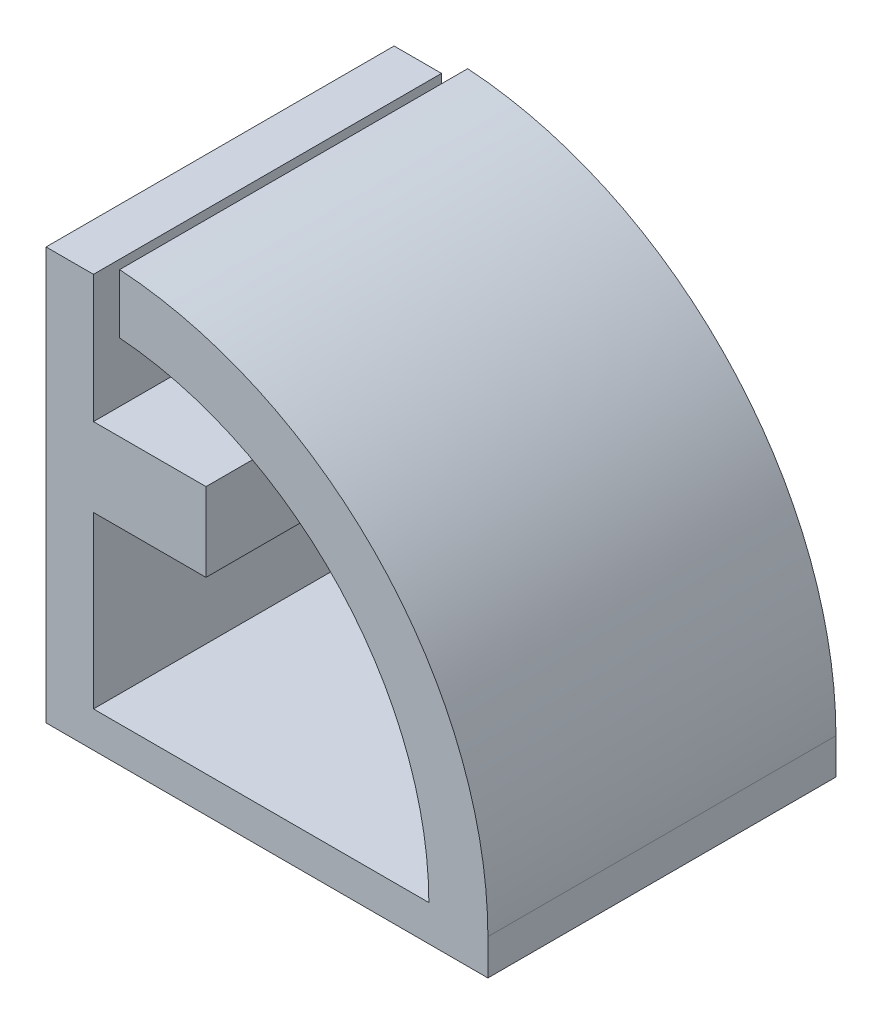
ISO-10303-21;
HEADER;
FILE_DESCRIPTION(('STEP AP214'),'2;1');
FILE_NAME('part.step','',(''),(''),'','','');
FILE_SCHEMA(('AUTOMOTIVE_DESIGN { 1 0 10303 214 1 1 1 1 }'));
ENDSEC;
DATA;
#1=APPLICATION_CONTEXT('core data for automotive mechanical design processes');
#2=APPLICATION_PROTOCOL_DEFINITION('international standard','automotive_design',2000,#1);
#3=PRODUCT_CONTEXT('',#1,'mechanical');
#4=PRODUCT('Part','Part','',(#3));
#5=PRODUCT_RELATED_PRODUCT_CATEGORY('part','',(#4));
#6=PRODUCT_DEFINITION_FORMATION('','',#4);
#7=PRODUCT_DEFINITION_CONTEXT('part definition',#1,'design');
#8=PRODUCT_DEFINITION('design','',#6,#7);
#9=PRODUCT_DEFINITION_SHAPE('','',#8);
#10=(LENGTH_UNIT() NAMED_UNIT(*) SI_UNIT(.MILLI.,.METRE.));
#11=(NAMED_UNIT(*) PLANE_ANGLE_UNIT() SI_UNIT($,.RADIAN.));
#12=(NAMED_UNIT(*) SI_UNIT($,.STERADIAN.) SOLID_ANGLE_UNIT());
#13=UNCERTAINTY_MEASURE_WITH_UNIT(LENGTH_MEASURE(1.E-05),#10,'distance_accuracy_value','');
#14=(GEOMETRIC_REPRESENTATION_CONTEXT(3) GLOBAL_UNCERTAINTY_ASSIGNED_CONTEXT((#13)) GLOBAL_UNIT_ASSIGNED_CONTEXT((#10,
#11,#12)) REPRESENTATION_CONTEXT('',''));
#15=CARTESIAN_POINT('',(0.,0.,0.));
#16=DIRECTION('',(0.,0.,1.));
#17=DIRECTION('',(1.,0.,0.));
#18=AXIS2_PLACEMENT_3D('',#15,#16,#17);
#19=CARTESIAN_POINT('',(168.839701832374,13.684496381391,66.5));
#20=DIRECTION('',(0.,-1.,0.));
#21=DIRECTION('',(0.,0.,-1.));
#22=AXIS2_PLACEMENT_3D('',#19,#20,#21);
#23=PLANE('',#22);
#24=DIRECTION('',(0.,0.,1.));
#25=VECTOR('',#24,1.);
#26=CARTESIAN_POINT('',(146.279375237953,13.684496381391,66.5));
#27=LINE('',#26,#25);
#28=CARTESIAN_POINT('',(146.279375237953,13.684496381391,-66.5));
#29=VERTEX_POINT('',#28);
#30=CARTESIAN_POINT('',(146.279375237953,13.684496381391,66.5));
#31=VERTEX_POINT('',#30);
#32=EDGE_CURVE('E140',#29,#31,#27,.T.);
#33=ORIENTED_EDGE('',*,*,#32,.F.);
#34=DIRECTION('',(-1.,0.,0.));
#35=VECTOR('',#34,1.);
#36=CARTESIAN_POINT('',(168.839701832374,13.684496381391,-66.5));
#37=LINE('',#36,#35);
#38=CARTESIAN_POINT('',(18.1175022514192,13.684496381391,-66.5));
#39=VERTEX_POINT('',#38);
#40=EDGE_CURVE('E216',#29,#39,#37,.T.);
#41=ORIENTED_EDGE('',*,*,#40,.T.);
#42=DIRECTION('',(0.,0.,-1.));
#43=VECTOR('',#42,1.);
#44=CARTESIAN_POINT('',(18.1175022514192,13.684496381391,66.5));
#45=LINE('',#44,#43);
#46=CARTESIAN_POINT('',(18.1175022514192,13.684496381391,66.5));
#47=VERTEX_POINT('',#46);
#48=EDGE_CURVE('E222',#47,#39,#45,.T.);
#49=ORIENTED_EDGE('',*,*,#48,.F.);
#50=DIRECTION('',(-1.,0.,0.));
#51=VECTOR('',#50,1.);
#52=CARTESIAN_POINT('',(168.839701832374,13.684496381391,66.5));
#53=LINE('',#52,#51);
#54=EDGE_CURVE('E48',#31,#47,#53,.T.);
#55=ORIENTED_EDGE('',*,*,#54,.F.);
#56=EDGE_LOOP('',(#33,#41,#49,#55));
#57=FACE_BOUND('',#56,.T.);
#58=ADVANCED_FACE('F33',(#57),#23,.F.);
#59=CARTESIAN_POINT('',(18.1175022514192,13.684496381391,66.5));
#60=DIRECTION('',(-1.,0.,0.));
#61=DIRECTION('',(0.,0.,1.));
#62=AXIS2_PLACEMENT_3D('',#59,#60,#61);
#63=PLANE('',#62);
#64=DIRECTION('',(0.,0.,-1.));
#65=VECTOR('',#64,1.);
#66=CARTESIAN_POINT('',(18.1175022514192,78.7188677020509,66.5));
#67=LINE('',#66,#65);
#68=CARTESIAN_POINT('',(18.1175022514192,78.7188677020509,66.5));
#69=VERTEX_POINT('',#68);
#70=CARTESIAN_POINT('',(18.1175022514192,78.7188677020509,-66.5));
#71=VERTEX_POINT('',#70);
#72=EDGE_CURVE('E177',#69,#71,#67,.T.);
#73=ORIENTED_EDGE('',*,*,#72,.F.);
#74=DIRECTION('',(0.,1.,0.));
#75=VECTOR('',#74,1.);
#76=CARTESIAN_POINT('',(18.1175022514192,13.684496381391,66.5));
#77=LINE('',#76,#75);
#78=EDGE_CURVE('E204',#47,#69,#77,.T.);
#79=ORIENTED_EDGE('',*,*,#78,.F.);
#80=ORIENTED_EDGE('',*,*,#48,.T.);
#81=DIRECTION('',(0.,1.,0.));
#82=VECTOR('',#81,1.);
#83=CARTESIAN_POINT('',(18.1175022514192,13.684496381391,-66.5));
#84=LINE('',#83,#82);
#85=EDGE_CURVE('E197',#39,#71,#84,.T.);
#86=ORIENTED_EDGE('',*,*,#85,.T.);
#87=EDGE_LOOP('',(#73,#79,#80,#86));
#88=FACE_BOUND('',#87,.T.);
#89=ADVANCED_FACE('F262',(#88),#63,.F.);
#90=DIRECTION('',(0.,0.,1.));
#91=VECTOR('',#90,1.);
#92=CARTESIAN_POINT('',(18.1175022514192,108.761947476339,66.5));
#93=LINE('',#92,#91);
#94=CARTESIAN_POINT('',(18.1175022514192,108.761947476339,-66.5));
#95=VERTEX_POINT('',#94);
#96=CARTESIAN_POINT('',(18.1175022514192,108.761947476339,66.5));
#97=VERTEX_POINT('',#96);
#98=EDGE_CURVE('E170',#95,#97,#93,.T.);
#99=ORIENTED_EDGE('',*,*,#98,.F.);
#100=CARTESIAN_POINT('',(18.1175022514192,157.514311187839,-66.5));
#101=VERTEX_POINT('',#100);
#102=EDGE_CURVE('E218',#95,#101,#84,.T.);
#103=ORIENTED_EDGE('',*,*,#102,.T.);
#104=DIRECTION('',(0.,0.,-1.));
#105=VECTOR('',#104,1.);
#106=CARTESIAN_POINT('',(18.1175022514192,157.514311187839,66.5));
#107=LINE('',#106,#105);
#108=CARTESIAN_POINT('',(18.1175022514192,157.514311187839,66.5));
#109=VERTEX_POINT('',#108);
#110=EDGE_CURVE('E207',#109,#101,#107,.T.);
#111=ORIENTED_EDGE('',*,*,#110,.F.);
#112=EDGE_CURVE('E56',#97,#109,#77,.T.);
#113=ORIENTED_EDGE('',*,*,#112,.F.);
#114=EDGE_LOOP('',(#99,#103,#111,#113));
#115=FACE_BOUND('',#114,.T.);
#116=ADVANCED_FACE('F248',(#115),#63,.F.);
#117=CARTESIAN_POINT('',(18.1175022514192,157.514311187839,66.5));
#118=DIRECTION('',(0.,-1.,0.));
#119=DIRECTION('',(0.,0.,-1.));
#120=AXIS2_PLACEMENT_3D('',#117,#118,#119);
#121=PLANE('',#120);
#122=DIRECTION('',(-1.,0.,0.));
#123=VECTOR('',#122,1.);
#124=CARTESIAN_POINT('',(18.1175022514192,157.514311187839,-66.5));
#125=LINE('',#124,#123);
#126=CARTESIAN_POINT('',(0.,157.514311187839,-66.5));
#127=VERTEX_POINT('',#126);
#128=EDGE_CURVE('E192',#101,#127,#125,.T.);
#129=ORIENTED_EDGE('',*,*,#128,.T.);
#130=DIRECTION('',(0.,0.,-1.));
#131=VECTOR('',#130,1.);
#132=CARTESIAN_POINT('',(0.,157.514311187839,66.5));
#133=LINE('',#132,#131);
#134=CARTESIAN_POINT('',(0.,157.514311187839,66.5));
#135=VERTEX_POINT('',#134);
#136=EDGE_CURVE('E12',#135,#127,#133,.T.);
#137=ORIENTED_EDGE('',*,*,#136,.F.);
#138=DIRECTION('',(-1.,0.,0.));
#139=VECTOR('',#138,1.);
#140=CARTESIAN_POINT('',(18.1175022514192,157.514311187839,66.5));
#141=LINE('',#140,#139);
#142=EDGE_CURVE('E193',#109,#135,#141,.T.);
#143=ORIENTED_EDGE('',*,*,#142,.F.);
#144=ORIENTED_EDGE('',*,*,#110,.T.);
#145=EDGE_LOOP('',(#129,#137,#143,#144));
#146=FACE_BOUND('',#145,.T.);
#147=ADVANCED_FACE('F35',(#146),#121,.F.);
#148=CARTESIAN_POINT('',(0.,157.514311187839,66.5));
#149=DIRECTION('',(1.,0.,0.));
#150=DIRECTION('',(0.,0.,-1.));
#151=AXIS2_PLACEMENT_3D('',#148,#149,#150);
#152=PLANE('',#151);
#153=DIRECTION('',(0.,-1.,0.));
#154=VECTOR('',#153,1.);
#155=CARTESIAN_POINT('',(0.,157.514311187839,-66.5));
#156=LINE('',#155,#154);
#157=CARTESIAN_POINT('',(0.,0.,-66.5));
#158=VERTEX_POINT('',#157);
#159=EDGE_CURVE('E210',#127,#158,#156,.T.);
#160=ORIENTED_EDGE('',*,*,#159,.T.);
#161=DIRECTION('',(0.,0.,-1.));
#162=VECTOR('',#161,1.);
#163=CARTESIAN_POINT('',(0.,0.,66.5));
#164=LINE('',#163,#162);
#165=CARTESIAN_POINT('',(0.,0.,66.5));
#166=VERTEX_POINT('',#165);
#167=EDGE_CURVE('E41',#166,#158,#164,.T.);
#168=ORIENTED_EDGE('',*,*,#167,.F.);
#169=DIRECTION('',(0.,-1.,0.));
#170=VECTOR('',#169,1.);
#171=CARTESIAN_POINT('',(0.,157.514311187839,66.5));
#172=LINE('',#171,#170);
#173=EDGE_CURVE('E196',#135,#166,#172,.T.);
#174=ORIENTED_EDGE('',*,*,#173,.F.);
#175=ORIENTED_EDGE('',*,*,#136,.T.);
#176=EDGE_LOOP('',(#160,#168,#174,#175));
#177=FACE_BOUND('',#176,.T.);
#178=ADVANCED_FACE('F243',(#177),#152,.F.);
#179=CARTESIAN_POINT('',(0.,0.,66.5));
#180=DIRECTION('',(0.,1.,0.));
#181=DIRECTION('',(0.,0.,1.));
#182=AXIS2_PLACEMENT_3D('',#179,#180,#181);
#183=PLANE('',#182);
#184=DIRECTION('',(1.,0.,0.));
#185=VECTOR('',#184,1.);
#186=CARTESIAN_POINT('',(0.,0.,-66.5));
#187=LINE('',#186,#185);
#188=CARTESIAN_POINT('',(168.839701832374,0.,-66.5));
#189=VERTEX_POINT('',#188);
#190=EDGE_CURVE('E212',#158,#189,#187,.T.);
#191=ORIENTED_EDGE('',*,*,#190,.T.);
#192=DIRECTION('',(0.,0.,-1.));
#193=VECTOR('',#192,1.);
#194=CARTESIAN_POINT('',(168.839701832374,0.,66.5));
#195=LINE('',#194,#193);
#196=CARTESIAN_POINT('',(168.839701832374,0.,66.5));
#197=VERTEX_POINT('',#196);
#198=EDGE_CURVE('E226',#197,#189,#195,.T.);
#199=ORIENTED_EDGE('',*,*,#198,.F.);
#200=DIRECTION('',(1.,0.,0.));
#201=VECTOR('',#200,1.);
#202=CARTESIAN_POINT('',(0.,0.,66.5));
#203=LINE('',#202,#201);
#204=EDGE_CURVE('E199',#166,#197,#203,.T.);
#205=ORIENTED_EDGE('',*,*,#204,.F.);
#206=ORIENTED_EDGE('',*,*,#167,.T.);
#207=EDGE_LOOP('',(#191,#199,#205,#206));
#208=FACE_BOUND('',#207,.T.);
#209=ADVANCED_FACE('F233',(#208),#183,.F.);
#210=CARTESIAN_POINT('',(168.839701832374,0.,66.5));
#211=DIRECTION('',(-1.,0.,0.));
#212=DIRECTION('',(0.,0.,1.));
#213=AXIS2_PLACEMENT_3D('',#210,#211,#212);
#214=PLANE('',#213);
#215=DIRECTION('',(0.,1.,0.));
#216=VECTOR('',#215,1.);
#217=CARTESIAN_POINT('',(168.839701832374,0.,-66.5));
#218=LINE('',#217,#216);
#219=CARTESIAN_POINT('',(168.839701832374,13.684496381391,-66.5));
#220=VERTEX_POINT('',#219);
#221=EDGE_CURVE('E214',#189,#220,#218,.T.);
#222=ORIENTED_EDGE('',*,*,#221,.T.);
#223=DIRECTION('',(0.,0.,-1.));
#224=VECTOR('',#223,1.);
#225=CARTESIAN_POINT('',(168.839701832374,13.684496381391,66.5));
#226=LINE('',#225,#224);
#227=CARTESIAN_POINT('',(168.839701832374,13.684496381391,66.5));
#228=VERTEX_POINT('',#227);
#229=EDGE_CURVE('E156',#228,#220,#226,.T.);
#230=ORIENTED_EDGE('',*,*,#229,.F.);
#231=DIRECTION('',(0.,1.,0.));
#232=VECTOR('',#231,1.);
#233=CARTESIAN_POINT('',(168.839701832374,0.,66.5));
#234=LINE('',#233,#232);
#235=EDGE_CURVE('E201',#197,#228,#234,.T.);
#236=ORIENTED_EDGE('',*,*,#235,.F.);
#237=ORIENTED_EDGE('',*,*,#198,.T.);
#238=EDGE_LOOP('',(#222,#230,#236,#237));
#239=FACE_BOUND('',#238,.T.);
#240=ADVANCED_FACE('F237',(#239),#214,.F.);
#241=CARTESIAN_POINT('',(0.,157.514311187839,66.5));
#242=DIRECTION('',(0.,0.,1.));
#243=DIRECTION('',(1.,0.,0.));
#244=AXIS2_PLACEMENT_3D('',#241,#242,#243);
#245=PLANE('',#244);
#246=ORIENTED_EDGE('',*,*,#142,.T.);
#247=ORIENTED_EDGE('',*,*,#173,.T.);
#248=ORIENTED_EDGE('',*,*,#204,.T.);
#249=ORIENTED_EDGE('',*,*,#235,.T.);
#250=CARTESIAN_POINT('',(18.1175022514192,13.684496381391,66.5));
#251=DIRECTION('',(0.,0.,-1.));
#252=DIRECTION('',(-1.,0.,0.));
#253=AXIS2_PLACEMENT_3D('',#250,#251,#252);
#254=CIRCLE('',#253,150.722199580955);
#255=CARTESIAN_POINT('',(28.1175022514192,164.07459394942,66.5));
#256=VERTEX_POINT('',#255);
#257=EDGE_CURVE('E158',#256,#228,#254,.T.);
#258=ORIENTED_EDGE('',*,*,#257,.F.);
#259=DIRECTION('',(0.,1.,0.));
#260=VECTOR('',#259,1.);
#261=CARTESIAN_POINT('',(28.1175022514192,13.6818657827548,66.5));
#262=LINE('',#261,#260);
#263=CARTESIAN_POINT('',(28.1175022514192,141.455642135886,66.5));
#264=VERTEX_POINT('',#263);
#265=EDGE_CURVE('E135',#264,#256,#262,.T.);
#266=ORIENTED_EDGE('',*,*,#265,.F.);
#267=CARTESIAN_POINT('',(18.1175022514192,13.684496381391,66.5));
#268=DIRECTION('',(0.,0.,-1.));
#269=DIRECTION('',(-1.,0.,0.));
#270=AXIS2_PLACEMENT_3D('',#267,#268,#269);
#271=CIRCLE('',#270,128.161872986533);
#272=EDGE_CURVE('E157',#264,#31,#271,.T.);
#273=ORIENTED_EDGE('',*,*,#272,.T.);
#274=ORIENTED_EDGE('',*,*,#54,.T.);
#275=ORIENTED_EDGE('',*,*,#78,.T.);
#276=DIRECTION('',(-1.,0.,0.));
#277=VECTOR('',#276,1.);
#278=CARTESIAN_POINT('',(61.1175022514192,78.7188677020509,66.5));
#279=LINE('',#278,#277);
#280=CARTESIAN_POINT('',(61.1175022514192,78.7188677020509,66.5));
#281=VERTEX_POINT('',#280);
#282=EDGE_CURVE('E189',#281,#69,#279,.T.);
#283=ORIENTED_EDGE('',*,*,#282,.F.);
#284=DIRECTION('',(0.,-1.,0.));
#285=VECTOR('',#284,1.);
#286=CARTESIAN_POINT('',(61.1175022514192,108.761947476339,66.5));
#287=LINE('',#286,#285);
#288=CARTESIAN_POINT('',(61.1175022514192,108.761947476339,66.5));
#289=VERTEX_POINT('',#288);
#290=EDGE_CURVE('E166',#289,#281,#287,.T.);
#291=ORIENTED_EDGE('',*,*,#290,.F.);
#292=DIRECTION('',(-1.,0.,0.));
#293=VECTOR('',#292,1.);
#294=CARTESIAN_POINT('',(61.1175022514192,108.761947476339,66.5));
#295=LINE('',#294,#293);
#296=EDGE_CURVE('E176',#289,#97,#295,.T.);
#297=ORIENTED_EDGE('',*,*,#296,.T.);
#298=ORIENTED_EDGE('',*,*,#112,.T.);
#299=EDGE_LOOP('',(#246,#247,#248,#249,#258,#266,#273,#274,#275,#283,#291,#297,#298));
#300=FACE_BOUND('',#299,.T.);
#301=ADVANCED_FACE('F240',(#300),#245,.T.);
#302=CARTESIAN_POINT('',(0.,157.514311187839,-66.5));
#303=DIRECTION('',(0.,0.,1.));
#304=DIRECTION('',(1.,0.,0.));
#305=AXIS2_PLACEMENT_3D('',#302,#303,#304);
#306=PLANE('',#305);
#307=ORIENTED_EDGE('',*,*,#128,.F.);
#308=ORIENTED_EDGE('',*,*,#102,.F.);
#309=DIRECTION('',(-1.,0.,0.));
#310=VECTOR('',#309,1.);
#311=CARTESIAN_POINT('',(61.1175022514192,108.761947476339,-66.5));
#312=LINE('',#311,#310);
#313=CARTESIAN_POINT('',(61.1175022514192,108.761947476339,-66.5));
#314=VERTEX_POINT('',#313);
#315=EDGE_CURVE('E183',#314,#95,#312,.T.);
#316=ORIENTED_EDGE('',*,*,#315,.F.);
#317=DIRECTION('',(0.,1.,0.));
#318=VECTOR('',#317,1.);
#319=CARTESIAN_POINT('',(61.1175022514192,108.761947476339,-66.5));
#320=LINE('',#319,#318);
#321=CARTESIAN_POINT('',(61.1175022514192,78.7188677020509,-66.5));
#322=VERTEX_POINT('',#321);
#323=EDGE_CURVE('E172',#322,#314,#320,.T.);
#324=ORIENTED_EDGE('',*,*,#323,.F.);
#325=DIRECTION('',(-1.,0.,0.));
#326=VECTOR('',#325,1.);
#327=CARTESIAN_POINT('',(61.1175022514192,78.7188677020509,-66.5));
#328=LINE('',#327,#326);
#329=EDGE_CURVE('E186',#322,#71,#328,.T.);
#330=ORIENTED_EDGE('',*,*,#329,.T.);
#331=ORIENTED_EDGE('',*,*,#85,.F.);
#332=ORIENTED_EDGE('',*,*,#40,.F.);
#333=CARTESIAN_POINT('',(18.1175022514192,13.684496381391,-66.5));
#334=DIRECTION('',(0.,0.,-1.));
#335=DIRECTION('',(-1.,0.,0.));
#336=AXIS2_PLACEMENT_3D('',#333,#334,#335);
#337=CIRCLE('',#336,128.161872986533);
#338=CARTESIAN_POINT('',(28.1175022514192,141.455642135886,-66.5));
#339=VERTEX_POINT('',#338);
#340=EDGE_CURVE('E151',#339,#29,#337,.T.);
#341=ORIENTED_EDGE('',*,*,#340,.F.);
#342=DIRECTION('',(0.,-1.,0.));
#343=VECTOR('',#342,1.);
#344=CARTESIAN_POINT('',(28.1175022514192,13.6818657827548,-66.5));
#345=LINE('',#344,#343);
#346=CARTESIAN_POINT('',(28.1175022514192,164.07459394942,-66.5));
#347=VERTEX_POINT('',#346);
#348=EDGE_CURVE('E132',#347,#339,#345,.T.);
#349=ORIENTED_EDGE('',*,*,#348,.F.);
#350=CARTESIAN_POINT('',(18.1175022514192,13.684496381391,-66.5));
#351=DIRECTION('',(0.,0.,-1.));
#352=DIRECTION('',(-1.,0.,0.));
#353=AXIS2_PLACEMENT_3D('',#350,#351,#352);
#354=CIRCLE('',#353,150.722199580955);
#355=EDGE_CURVE('E148',#347,#220,#354,.T.);
#356=ORIENTED_EDGE('',*,*,#355,.T.);
#357=ORIENTED_EDGE('',*,*,#221,.F.);
#358=ORIENTED_EDGE('',*,*,#190,.F.);
#359=ORIENTED_EDGE('',*,*,#159,.F.);
#360=EDGE_LOOP('',(#307,#308,#316,#324,#330,#331,#332,#341,#349,#356,#357,#358,#359));
#361=FACE_BOUND('',#360,.T.);
#362=ADVANCED_FACE('F146',(#361),#306,.F.);
#363=CARTESIAN_POINT('',(61.1175022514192,78.7188677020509,66.5));
#364=DIRECTION('',(0.,1.,0.));
#365=DIRECTION('',(0.,0.,1.));
#366=AXIS2_PLACEMENT_3D('',#363,#364,#365);
#367=PLANE('',#366);
#368=ORIENTED_EDGE('',*,*,#72,.T.);
#369=ORIENTED_EDGE('',*,*,#329,.F.);
#370=DIRECTION('',(0.,0.,-1.));
#371=VECTOR('',#370,1.);
#372=CARTESIAN_POINT('',(61.1175022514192,78.7188677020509,66.5));
#373=LINE('',#372,#371);
#374=EDGE_CURVE('E169',#281,#322,#373,.T.);
#375=ORIENTED_EDGE('',*,*,#374,.F.);
#376=ORIENTED_EDGE('',*,*,#282,.T.);
#377=EDGE_LOOP('',(#368,#369,#375,#376));
#378=FACE_BOUND('',#377,.T.);
#379=ADVANCED_FACE('F259',(#378),#367,.F.);
#380=CARTESIAN_POINT('',(61.1175022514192,108.761947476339,66.5));
#381=DIRECTION('',(0.,-1.,0.));
#382=DIRECTION('',(0.,0.,-1.));
#383=AXIS2_PLACEMENT_3D('',#380,#381,#382);
#384=PLANE('',#383);
#385=ORIENTED_EDGE('',*,*,#98,.T.);
#386=ORIENTED_EDGE('',*,*,#296,.F.);
#387=DIRECTION('',(0.,0.,1.));
#388=VECTOR('',#387,1.);
#389=CARTESIAN_POINT('',(61.1175022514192,108.761947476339,66.5));
#390=LINE('',#389,#388);
#391=EDGE_CURVE('E174',#314,#289,#390,.T.);
#392=ORIENTED_EDGE('',*,*,#391,.F.);
#393=ORIENTED_EDGE('',*,*,#315,.T.);
#394=EDGE_LOOP('',(#385,#386,#392,#393));
#395=FACE_BOUND('',#394,.T.);
#396=ADVANCED_FACE('F251',(#395),#384,.F.);
#397=CARTESIAN_POINT('',(61.1175022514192,78.7188677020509,66.5));
#398=DIRECTION('',(1.,0.,0.));
#399=DIRECTION('',(0.,0.,-1.));
#400=AXIS2_PLACEMENT_3D('',#397,#398,#399);
#401=PLANE('',#400);
#402=ORIENTED_EDGE('',*,*,#290,.T.);
#403=ORIENTED_EDGE('',*,*,#374,.T.);
#404=ORIENTED_EDGE('',*,*,#323,.T.);
#405=ORIENTED_EDGE('',*,*,#391,.T.);
#406=EDGE_LOOP('',(#402,#403,#404,#405));
#407=FACE_BOUND('',#406,.T.);
#408=ADVANCED_FACE('F254',(#407),#401,.T.);
#409=CARTESIAN_POINT('',(18.1175022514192,13.684496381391,66.5));
#410=DIRECTION('',(0.,0.,-1.));
#411=DIRECTION('',(-1.,0.,0.));
#412=AXIS2_PLACEMENT_3D('',#409,#410,#411);
#413=CYLINDRICAL_SURFACE('',#412,150.722199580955);
#414=DIRECTION('',(0.,0.,-1.));
#415=VECTOR('',#414,1.);
#416=CARTESIAN_POINT('',(28.1175022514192,164.07459394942,66.5));
#417=LINE('',#416,#415);
#418=EDGE_CURVE('E129',#256,#347,#417,.T.);
#419=ORIENTED_EDGE('',*,*,#418,.F.);
#420=ORIENTED_EDGE('',*,*,#257,.T.);
#421=ORIENTED_EDGE('',*,*,#229,.T.);
#422=ORIENTED_EDGE('',*,*,#355,.F.);
#423=EDGE_LOOP('',(#419,#420,#421,#422));
#424=FACE_BOUND('',#423,.T.);
#425=ADVANCED_FACE('F154',(#424),#413,.T.);
#426=CARTESIAN_POINT('',(18.1175022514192,13.684496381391,66.5));
#427=DIRECTION('',(0.,0.,-1.));
#428=DIRECTION('',(-1.,0.,0.));
#429=AXIS2_PLACEMENT_3D('',#426,#427,#428);
#430=CYLINDRICAL_SURFACE('',#429,128.161872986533);
#431=DIRECTION('',(0.,0.,-1.));
#432=VECTOR('',#431,1.);
#433=CARTESIAN_POINT('',(28.1175022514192,141.455642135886,66.5));
#434=LINE('',#433,#432);
#435=EDGE_CURVE('E152',#339,#264,#434,.F.);
#436=ORIENTED_EDGE('',*,*,#435,.F.);
#437=ORIENTED_EDGE('',*,*,#340,.T.);
#438=ORIENTED_EDGE('',*,*,#32,.T.);
#439=ORIENTED_EDGE('',*,*,#272,.F.);
#440=EDGE_LOOP('',(#436,#437,#438,#439));
#441=FACE_BOUND('',#440,.T.);
#442=ADVANCED_FACE('F266',(#441),#430,.F.);
#443=CARTESIAN_POINT('',(28.1175022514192,13.684496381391,66.5));
#444=DIRECTION('',(-1.,0.,0.));
#445=DIRECTION('',(0.,0.,1.));
#446=AXIS2_PLACEMENT_3D('',#443,#444,#445);
#447=PLANE('',#446);
#448=ORIENTED_EDGE('',*,*,#418,.T.);
#449=ORIENTED_EDGE('',*,*,#348,.T.);
#450=ORIENTED_EDGE('',*,*,#435,.T.);
#451=ORIENTED_EDGE('',*,*,#265,.T.);
#452=EDGE_LOOP('',(#448,#449,#450,#451));
#453=FACE_BOUND('',#452,.T.);
#454=ADVANCED_FACE('F131',(#453),#447,.T.);
#455=CLOSED_SHELL('',(#58,#89,#116,#147,#178,#209,#240,#301,#362,#379,#396,#408,#425,#442,#454));
#456=MANIFOLD_SOLID_BREP('B2',#455);
#457=ADVANCED_BREP_SHAPE_REPRESENTATION('',(#18,#456),#14);
#458=SHAPE_DEFINITION_REPRESENTATION(#9,#457);
ENDSEC;
END-ISO-10303-21;
